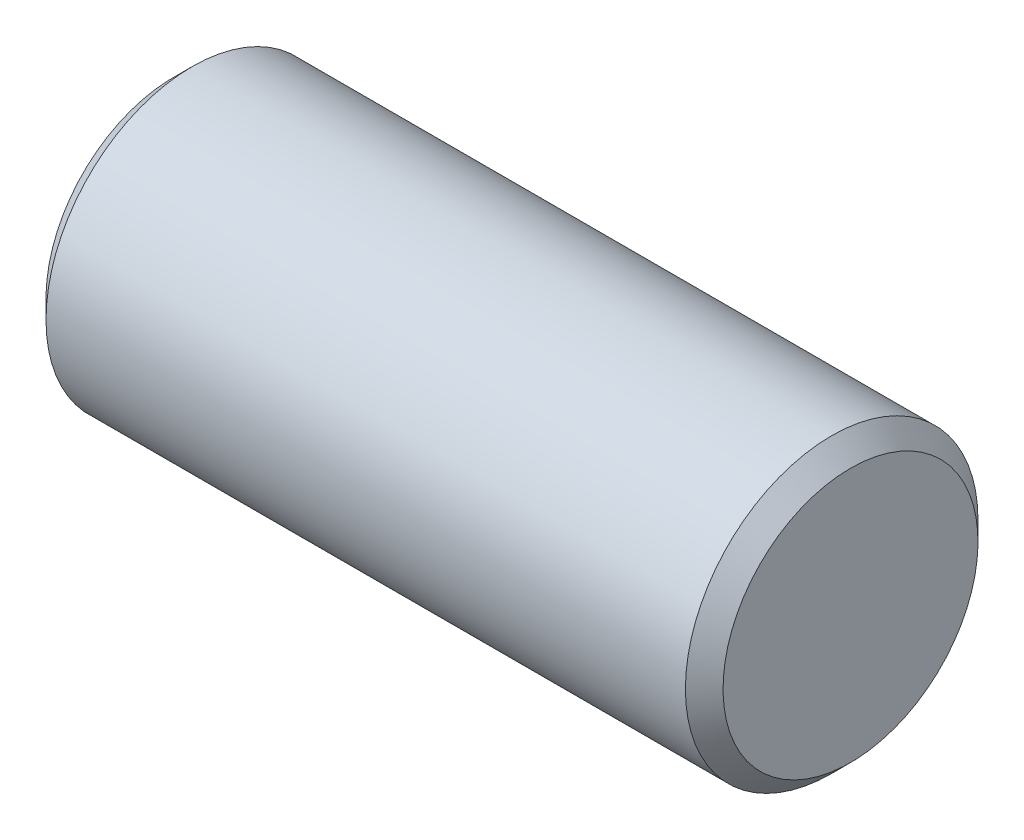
from build123d import *

# Parameters (mm, degrees)
SKETCH1_W     = 9.14
SKETCH1_H     = 1.975
CHAMFER1_SIZE = 0.254


with BuildPart() as part:
    # Sketch1 → Revolve1 (revolve)
    with BuildSketch(Plane.XY):
        with Locations((0, 0.9875)):
            Rectangle(SKETCH1_W, SKETCH1_H)
    revolve(axis=Axis((4.57, 0, 0), (-1, 0, 0)))

    # Chamfer1
    chamfer1_edges = [part.edges().sort_by_distance(p)[0] for p in [
        (4.57, -1.975, 0),
        (-4.57, -1.975, 0),
    ]]
    chamfer(chamfer1_edges, length=CHAMFER1_SIZE)


solid = part.part
